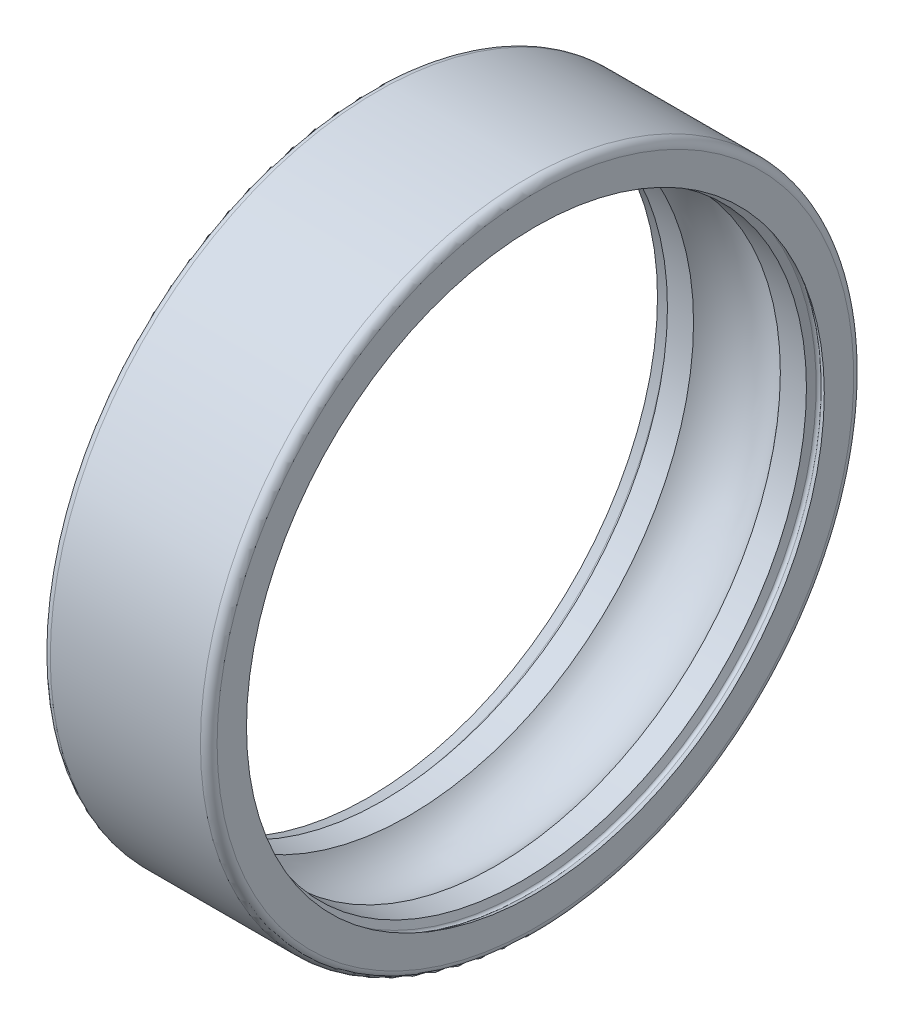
ISO-10303-21;
HEADER;
FILE_DESCRIPTION(('STEP AP214'),'2;1');
FILE_NAME('part.step','',(''),(''),'','','');
FILE_SCHEMA(('AUTOMOTIVE_DESIGN { 1 0 10303 214 1 1 1 1 }'));
ENDSEC;
DATA;
#1=APPLICATION_CONTEXT('core data for automotive mechanical design processes');
#2=APPLICATION_PROTOCOL_DEFINITION('international standard','automotive_design',2000,#1);
#3=PRODUCT_CONTEXT('',#1,'mechanical');
#4=PRODUCT('Part','Part','',(#3));
#5=PRODUCT_RELATED_PRODUCT_CATEGORY('part','',(#4));
#6=PRODUCT_DEFINITION_FORMATION('','',#4);
#7=PRODUCT_DEFINITION_CONTEXT('part definition',#1,'design');
#8=PRODUCT_DEFINITION('design','',#6,#7);
#9=PRODUCT_DEFINITION_SHAPE('','',#8);
#10=(LENGTH_UNIT() NAMED_UNIT(*) SI_UNIT(.MILLI.,.METRE.));
#11=(NAMED_UNIT(*) PLANE_ANGLE_UNIT() SI_UNIT($,.RADIAN.));
#12=(NAMED_UNIT(*) SI_UNIT($,.STERADIAN.) SOLID_ANGLE_UNIT());
#13=UNCERTAINTY_MEASURE_WITH_UNIT(LENGTH_MEASURE(1.E-05),#10,'distance_accuracy_value','');
#14=(GEOMETRIC_REPRESENTATION_CONTEXT(3) GLOBAL_UNCERTAINTY_ASSIGNED_CONTEXT((#13)) GLOBAL_UNIT_ASSIGNED_CONTEXT((#10,
#11,#12)) REPRESENTATION_CONTEXT('',''));
#15=CARTESIAN_POINT('',(0.,0.,0.));
#16=DIRECTION('',(0.,0.,1.));
#17=DIRECTION('',(1.,0.,0.));
#18=AXIS2_PLACEMENT_3D('',#15,#16,#17);
#19=CARTESIAN_POINT('',(0.599999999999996,0.,0.));
#20=DIRECTION('',(-1.,0.,0.));
#21=DIRECTION('',(0.,0.,1.));
#22=AXIS2_PLACEMENT_3D('',#19,#20,#21);
#23=TOROIDAL_SURFACE('',#22,20.9,0.200000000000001);
#24=CARTESIAN_POINT('',(0.782287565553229,0.,0.));
#25=DIRECTION('',(-1.,0.,0.));
#26=DIRECTION('',(0.,0.,1.));
#27=AXIS2_PLACEMENT_3D('',#24,#25,#26);
#28=CIRCLE('',#27,20.9822875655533);
#29=CARTESIAN_POINT('',(0.782287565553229,0.,20.9822875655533));
#30=VERTEX_POINT('',#29);
#31=EDGE_CURVE('E10',#30,#30,#28,.T.);
#32=ORIENTED_EDGE('',*,*,#31,.F.);
#33=EDGE_LOOP('',(#32));
#34=FACE_BOUND('',#33,.T.);
#35=CARTESIAN_POINT('',(0.5,0.,0.));
#36=DIRECTION('',(-1.,0.,0.));
#37=DIRECTION('',(0.,0.,1.));
#38=AXIS2_PLACEMENT_3D('',#35,#36,#37);
#39=CIRCLE('',#38,21.0732050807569);
#40=CARTESIAN_POINT('',(0.5,0.,21.0732050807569));
#41=VERTEX_POINT('',#40);
#42=EDGE_CURVE('E77',#41,#41,#39,.T.);
#43=ORIENTED_EDGE('',*,*,#42,.T.);
#44=EDGE_LOOP('',(#43));
#45=FACE_BOUND('',#44,.T.);
#46=ADVANCED_FACE('F31',(#34,#45),#23,.F.);
#47=CARTESIAN_POINT('',(0.782287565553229,0.,0.));
#48=DIRECTION('',(-1.,0.,0.));
#49=DIRECTION('',(0.,0.,1.));
#50=AXIS2_PLACEMENT_3D('',#47,#48,#49);
#51=CONICAL_SURFACE('',#50,20.9822875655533,1.14676528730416);
#52=CARTESIAN_POINT('',(1.,0.,0.));
#53=DIRECTION('',(-1.,0.,0.));
#54=DIRECTION('',(0.,0.,1.));
#55=AXIS2_PLACEMENT_3D('',#52,#53,#54);
#56=CIRCLE('',#55,20.5);
#57=CARTESIAN_POINT('',(1.,0.,20.5));
#58=VERTEX_POINT('',#57);
#59=EDGE_CURVE('E37',#58,#58,#56,.T.);
#60=ORIENTED_EDGE('',*,*,#59,.F.);
#61=EDGE_LOOP('',(#60));
#62=FACE_BOUND('',#61,.T.);
#63=ORIENTED_EDGE('',*,*,#31,.T.);
#64=EDGE_LOOP('',(#63));
#65=FACE_BOUND('',#64,.T.);
#66=ADVANCED_FACE('F150',(#62,#65),#51,.F.);
#67=CARTESIAN_POINT('',(-13.,0.,0.));
#68=DIRECTION('',(-1.,0.,0.));
#69=DIRECTION('',(0.,0.,1.));
#70=AXIS2_PLACEMENT_3D('',#67,#68,#69);
#71=CYLINDRICAL_SURFACE('',#70,20.5);
#72=CARTESIAN_POINT('',(2.87750100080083,0.,0.));
#73=DIRECTION('',(-1.,0.,0.));
#74=DIRECTION('',(0.,0.,1.));
#75=AXIS2_PLACEMENT_3D('',#72,#73,#74);
#76=CIRCLE('',#75,20.5);
#77=CARTESIAN_POINT('',(2.87750100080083,0.,20.5));
#78=VERTEX_POINT('',#77);
#79=EDGE_CURVE('E41',#78,#78,#76,.T.);
#80=ORIENTED_EDGE('',*,*,#79,.F.);
#81=EDGE_LOOP('',(#80));
#82=FACE_BOUND('',#81,.T.);
#83=ORIENTED_EDGE('',*,*,#59,.T.);
#84=EDGE_LOOP('',(#83));
#85=FACE_BOUND('',#84,.T.);
#86=ADVANCED_FACE('F145',(#82,#85),#71,.F.);
#87=CARTESIAN_POINT('',(6.,0.,0.));
#88=DIRECTION('',(-1.,0.,0.));
#89=DIRECTION('',(0.,0.,1.));
#90=AXIS2_PLACEMENT_3D('',#87,#88,#89);
#91=TOROIDAL_SURFACE('',#90,18.,4.);
#92=CARTESIAN_POINT('',(9.12249899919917,0.,0.));
#93=DIRECTION('',(-1.,0.,0.));
#94=DIRECTION('',(0.,0.,1.));
#95=AXIS2_PLACEMENT_3D('',#92,#93,#94);
#96=CIRCLE('',#95,20.5);
#97=CARTESIAN_POINT('',(9.12249899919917,0.,20.5));
#98=VERTEX_POINT('',#97);
#99=EDGE_CURVE('E45',#98,#98,#96,.T.);
#100=ORIENTED_EDGE('',*,*,#99,.F.);
#101=EDGE_LOOP('',(#100));
#102=FACE_BOUND('',#101,.T.);
#103=ORIENTED_EDGE('',*,*,#79,.T.);
#104=EDGE_LOOP('',(#103));
#105=FACE_BOUND('',#104,.T.);
#106=ADVANCED_FACE('F139',(#102,#105),#91,.F.);
#107=CARTESIAN_POINT('',(-13.,0.,0.));
#108=DIRECTION('',(-1.,0.,0.));
#109=DIRECTION('',(0.,0.,1.));
#110=AXIS2_PLACEMENT_3D('',#107,#108,#109);
#111=CYLINDRICAL_SURFACE('',#110,20.5);
#112=CARTESIAN_POINT('',(11.,0.,0.));
#113=DIRECTION('',(-1.,0.,0.));
#114=DIRECTION('',(0.,0.,1.));
#115=AXIS2_PLACEMENT_3D('',#112,#113,#114);
#116=CIRCLE('',#115,20.5);
#117=CARTESIAN_POINT('',(11.,0.,20.5));
#118=VERTEX_POINT('',#117);
#119=EDGE_CURVE('E50',#118,#118,#116,.T.);
#120=ORIENTED_EDGE('',*,*,#119,.F.);
#121=EDGE_LOOP('',(#120));
#122=FACE_BOUND('',#121,.T.);
#123=ORIENTED_EDGE('',*,*,#99,.T.);
#124=EDGE_LOOP('',(#123));
#125=FACE_BOUND('',#124,.T.);
#126=ADVANCED_FACE('F133',(#122,#125),#111,.F.);
#127=CARTESIAN_POINT('',(11.,0.,0.));
#128=DIRECTION('',(1.,0.,0.));
#129=DIRECTION('',(0.,0.,-1.));
#130=AXIS2_PLACEMENT_3D('',#127,#128,#129);
#131=CONICAL_SURFACE('',#130,20.5,1.14676528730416);
#132=CARTESIAN_POINT('',(11.2177124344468,0.,0.));
#133=DIRECTION('',(-1.,0.,0.));
#134=DIRECTION('',(0.,0.,1.));
#135=AXIS2_PLACEMENT_3D('',#132,#133,#134);
#136=CIRCLE('',#135,20.9822875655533);
#137=CARTESIAN_POINT('',(11.2177124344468,0.,20.9822875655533));
#138=VERTEX_POINT('',#137);
#139=EDGE_CURVE('E53',#138,#138,#136,.T.);
#140=ORIENTED_EDGE('',*,*,#139,.F.);
#141=EDGE_LOOP('',(#140));
#142=FACE_BOUND('',#141,.T.);
#143=ORIENTED_EDGE('',*,*,#119,.T.);
#144=EDGE_LOOP('',(#143));
#145=FACE_BOUND('',#144,.T.);
#146=ADVANCED_FACE('F127',(#142,#145),#131,.F.);
#147=CARTESIAN_POINT('',(11.4,0.,0.));
#148=DIRECTION('',(-1.,0.,0.));
#149=DIRECTION('',(0.,0.,1.));
#150=AXIS2_PLACEMENT_3D('',#147,#148,#149);
#151=TOROIDAL_SURFACE('',#150,20.9,0.200000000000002);
#152=CARTESIAN_POINT('',(11.5,0.,0.));
#153=DIRECTION('',(-1.,0.,0.));
#154=DIRECTION('',(0.,0.,1.));
#155=AXIS2_PLACEMENT_3D('',#152,#153,#154);
#156=CIRCLE('',#155,21.0732050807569);
#157=CARTESIAN_POINT('',(11.5,0.,21.0732050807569));
#158=VERTEX_POINT('',#157);
#159=EDGE_CURVE('E56',#158,#158,#156,.T.);
#160=ORIENTED_EDGE('',*,*,#159,.F.);
#161=EDGE_LOOP('',(#160));
#162=FACE_BOUND('',#161,.T.);
#163=ORIENTED_EDGE('',*,*,#139,.T.);
#164=EDGE_LOOP('',(#163));
#165=FACE_BOUND('',#164,.T.);
#166=ADVANCED_FACE('F121',(#162,#165),#151,.F.);
#167=CARTESIAN_POINT('',(11.5,0.,0.));
#168=DIRECTION('',(-1.,0.,0.));
#169=DIRECTION('',(0.,0.,1.));
#170=AXIS2_PLACEMENT_3D('',#167,#168,#169);
#171=CONICAL_SURFACE('',#170,21.0732050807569,0.523598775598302);
#172=CARTESIAN_POINT('',(12.,0.,0.));
#173=DIRECTION('',(-1.,0.,0.));
#174=DIRECTION('',(0.,0.,1.));
#175=AXIS2_PLACEMENT_3D('',#172,#173,#174);
#176=CIRCLE('',#175,20.7845299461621);
#177=CARTESIAN_POINT('',(12.,0.,20.7845299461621));
#178=VERTEX_POINT('',#177);
#179=EDGE_CURVE('E59',#178,#178,#176,.T.);
#180=ORIENTED_EDGE('',*,*,#179,.F.);
#181=EDGE_LOOP('',(#180));
#182=FACE_BOUND('',#181,.T.);
#183=ORIENTED_EDGE('',*,*,#159,.T.);
#184=EDGE_LOOP('',(#183));
#185=FACE_BOUND('',#184,.T.);
#186=ADVANCED_FACE('F115',(#182,#185),#171,.F.);
#187=CARTESIAN_POINT('',(12.,22.9,0.));
#188=DIRECTION('',(-1.,0.,0.));
#189=DIRECTION('',(0.,0.,1.));
#190=AXIS2_PLACEMENT_3D('',#187,#188,#189);
#191=PLANE('',#190);
#192=CARTESIAN_POINT('',(12.,0.,0.));
#193=DIRECTION('',(-1.,0.,0.));
#194=DIRECTION('',(0.,0.,1.));
#195=AXIS2_PLACEMENT_3D('',#192,#193,#194);
#196=CIRCLE('',#195,22.9);
#197=CARTESIAN_POINT('',(12.,0.,22.9));
#198=VERTEX_POINT('',#197);
#199=EDGE_CURVE('E62',#198,#198,#196,.T.);
#200=ORIENTED_EDGE('',*,*,#199,.F.);
#201=EDGE_LOOP('',(#200));
#202=FACE_BOUND('',#201,.T.);
#203=ORIENTED_EDGE('',*,*,#179,.T.);
#204=EDGE_LOOP('',(#203));
#205=FACE_BOUND('',#204,.T.);
#206=ADVANCED_FACE('F109',(#202,#205),#191,.F.);
#207=CARTESIAN_POINT('',(11.4,0.,0.));
#208=DIRECTION('',(-1.,0.,0.));
#209=DIRECTION('',(0.,0.,1.));
#210=AXIS2_PLACEMENT_3D('',#207,#208,#209);
#211=TOROIDAL_SURFACE('',#210,22.9,0.6);
#212=CARTESIAN_POINT('',(11.4,0.,0.));
#213=DIRECTION('',(-1.,0.,0.));
#214=DIRECTION('',(0.,0.,1.));
#215=AXIS2_PLACEMENT_3D('',#212,#213,#214);
#216=CIRCLE('',#215,23.5);
#217=CARTESIAN_POINT('',(11.4,0.,23.5));
#218=VERTEX_POINT('',#217);
#219=EDGE_CURVE('E65',#218,#218,#216,.T.);
#220=ORIENTED_EDGE('',*,*,#219,.F.);
#221=EDGE_LOOP('',(#220));
#222=FACE_BOUND('',#221,.T.);
#223=ORIENTED_EDGE('',*,*,#199,.T.);
#224=EDGE_LOOP('',(#223));
#225=FACE_BOUND('',#224,.T.);
#226=ADVANCED_FACE('F103',(#222,#225),#211,.T.);
#227=CARTESIAN_POINT('',(-13.,0.,0.));
#228=DIRECTION('',(-1.,0.,0.));
#229=DIRECTION('',(0.,0.,1.));
#230=AXIS2_PLACEMENT_3D('',#227,#228,#229);
#231=CYLINDRICAL_SURFACE('',#230,23.5);
#232=CARTESIAN_POINT('',(0.599999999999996,0.,0.));
#233=DIRECTION('',(-1.,0.,0.));
#234=DIRECTION('',(0.,0.,1.));
#235=AXIS2_PLACEMENT_3D('',#232,#233,#234);
#236=CIRCLE('',#235,23.5);
#237=CARTESIAN_POINT('',(0.599999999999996,0.,23.5));
#238=VERTEX_POINT('',#237);
#239=EDGE_CURVE('E68',#238,#238,#236,.T.);
#240=ORIENTED_EDGE('',*,*,#239,.F.);
#241=EDGE_LOOP('',(#240));
#242=FACE_BOUND('',#241,.T.);
#243=ORIENTED_EDGE('',*,*,#219,.T.);
#244=EDGE_LOOP('',(#243));
#245=FACE_BOUND('',#244,.T.);
#246=ADVANCED_FACE('F97',(#242,#245),#231,.T.);
#247=CARTESIAN_POINT('',(0.599999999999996,0.,0.));
#248=DIRECTION('',(-1.,0.,0.));
#249=DIRECTION('',(0.,0.,1.));
#250=AXIS2_PLACEMENT_3D('',#247,#248,#249);
#251=TOROIDAL_SURFACE('',#250,22.9,0.599999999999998);
#252=CARTESIAN_POINT('',(0.,0.,0.));
#253=DIRECTION('',(-1.,0.,0.));
#254=DIRECTION('',(0.,0.,1.));
#255=AXIS2_PLACEMENT_3D('',#252,#253,#254);
#256=CIRCLE('',#255,22.9);
#257=CARTESIAN_POINT('',(0.,0.,22.9));
#258=VERTEX_POINT('',#257);
#259=EDGE_CURVE('E71',#258,#258,#256,.T.);
#260=ORIENTED_EDGE('',*,*,#259,.F.);
#261=EDGE_LOOP('',(#260));
#262=FACE_BOUND('',#261,.T.);
#263=ORIENTED_EDGE('',*,*,#239,.T.);
#264=EDGE_LOOP('',(#263));
#265=FACE_BOUND('',#264,.T.);
#266=ADVANCED_FACE('F91',(#262,#265),#251,.T.);
#267=CARTESIAN_POINT('',(0.,20.7845299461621,0.));
#268=DIRECTION('',(1.,0.,0.));
#269=DIRECTION('',(0.,0.,-1.));
#270=AXIS2_PLACEMENT_3D('',#267,#268,#269);
#271=PLANE('',#270);
#272=CARTESIAN_POINT('',(0.,0.,0.));
#273=DIRECTION('',(-1.,0.,0.));
#274=DIRECTION('',(0.,0.,1.));
#275=AXIS2_PLACEMENT_3D('',#272,#273,#274);
#276=CIRCLE('',#275,20.7845299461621);
#277=CARTESIAN_POINT('',(0.,0.,20.7845299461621));
#278=VERTEX_POINT('',#277);
#279=EDGE_CURVE('E74',#278,#278,#276,.T.);
#280=ORIENTED_EDGE('',*,*,#279,.F.);
#281=EDGE_LOOP('',(#280));
#282=FACE_BOUND('',#281,.T.);
#283=ORIENTED_EDGE('',*,*,#259,.T.);
#284=EDGE_LOOP('',(#283));
#285=FACE_BOUND('',#284,.T.);
#286=ADVANCED_FACE('F85',(#282,#285),#271,.F.);
#287=CARTESIAN_POINT('',(0.,0.,0.));
#288=DIRECTION('',(1.,0.,0.));
#289=DIRECTION('',(0.,0.,-1.));
#290=AXIS2_PLACEMENT_3D('',#287,#288,#289);
#291=CONICAL_SURFACE('',#290,20.7845299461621,0.5235987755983);
#292=ORIENTED_EDGE('',*,*,#42,.F.);
#293=EDGE_LOOP('',(#292));
#294=FACE_BOUND('',#293,.T.);
#295=ORIENTED_EDGE('',*,*,#279,.T.);
#296=EDGE_LOOP('',(#295));
#297=FACE_BOUND('',#296,.T.);
#298=ADVANCED_FACE('F82',(#294,#297),#291,.F.);
#299=CLOSED_SHELL('',(#46,#66,#86,#106,#126,#146,#166,#186,#206,#226,#246,#266,#286,#298));
#300=MANIFOLD_SOLID_BREP('B2',#299);
#301=ADVANCED_BREP_SHAPE_REPRESENTATION('',(#18,#300),#14);
#302=SHAPE_DEFINITION_REPRESENTATION(#9,#301);
ENDSEC;
END-ISO-10303-21;
